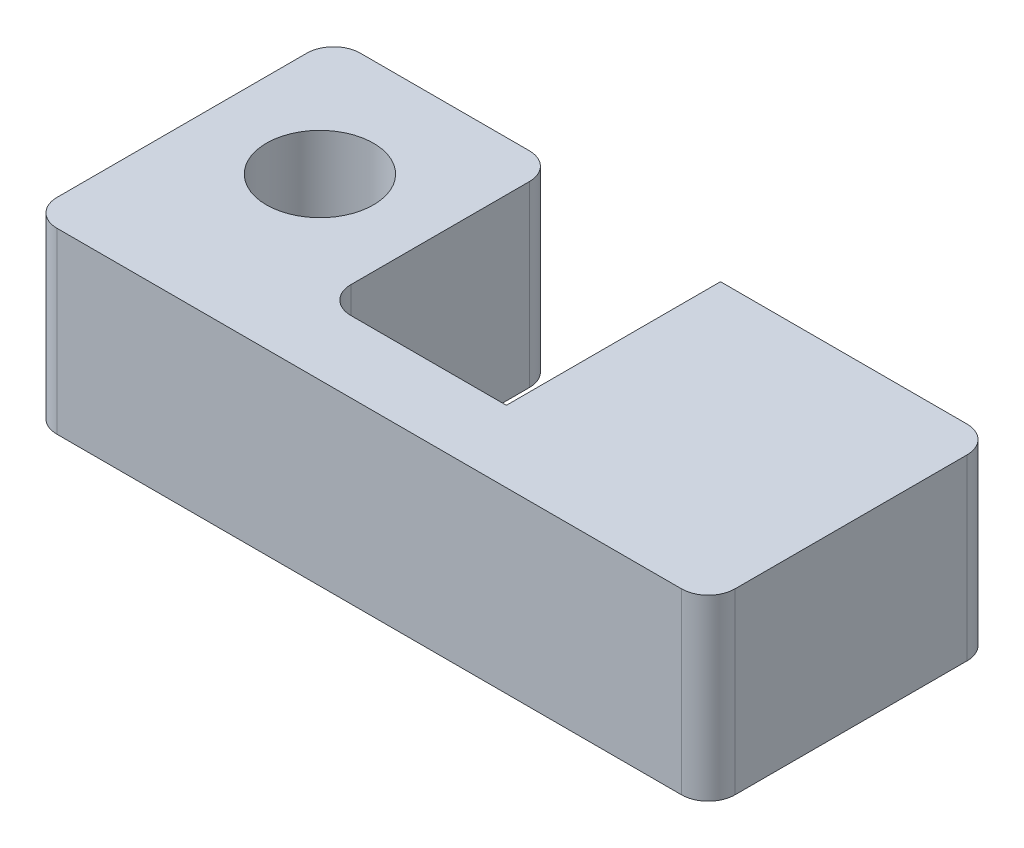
from build123d import *

# Parameters (mm, degrees)
SKETCH_9_R          = 3
EXTRUDE_6_DEPTH     = 10
CUT_EXTRUDE_4_DEPTH = 13


with BuildPart() as part:
    # Sketch 9 → Extrude 6 (new body)
    with BuildSketch(Plane(origin=(0, 0, 0), x_dir=(1, 0, 0), z_dir=(0, 1, 0))):
        with BuildLine():
            Line((6.235, 5.5), (6.235, -4.5))
            ThreePointArc((6.235, -4.5), (6.674339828, -5.560660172), (7.735, -6))
            Line((7.735, -6), (16.45, -6))
            Line((16.45, -6), (16.45, 6))
            Line((16.45, 6), (30.265, 6))
            ThreePointArc((30.265, 6), (31.325660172, 5.560660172), (31.765, 4.5))
            Line((31.765, 4.5), (31.765, -8.5))
            ThreePointArc((31.765, -8.5), (31.325660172, -9.560660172), (30.265, -10))
            Line((30.265, -10), (-4.735, -10))
            ThreePointArc((-4.735, -10), (-5.795660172, -9.560660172), (-6.235, -8.5))
            Line((-6.235, -8.5), (-6.235, 5.5))
            ThreePointArc((-6.235, 5.5), (-5.795660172, 6.560660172), (-4.735, 7))
            Line((-4.735, 7), (4.735, 7))
            ThreePointArc((4.735, 7), (5.795660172, 6.560660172), (6.235, 5.5))
        make_face()
        with Locations(Location((0, 0, 0), (0, 0, 270))):
            Circle(SKETCH_9_R, mode=Mode.SUBTRACT)
    extrude(amount=-EXTRUDE_6_DEPTH)

    # Sketch 10 → Cut-Extrude 4 (cut)
    with BuildSketch(Plane(origin=(0, 0, -7), x_dir=(-1, 0, 0), z_dir=(0, 0, -1))):
        Polygon((-16.45, -1), (-28, -10), (-16.45, -10), align=None)
    extrude(amount=-CUT_EXTRUDE_4_DEPTH, mode=Mode.SUBTRACT)


solid = part.part
